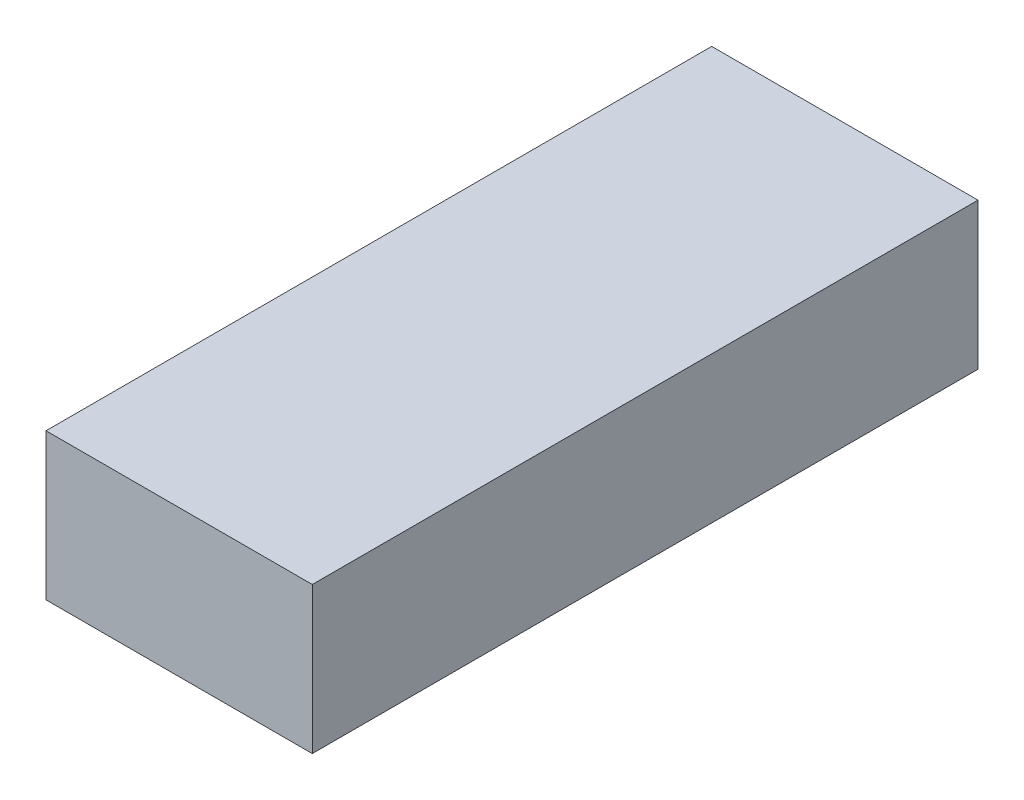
ISO-10303-21;
HEADER;
FILE_DESCRIPTION(('STEP AP214'),'2;1');
FILE_NAME('part.step','',(''),(''),'','','');
FILE_SCHEMA(('AUTOMOTIVE_DESIGN { 1 0 10303 214 1 1 1 1 }'));
ENDSEC;
DATA;
#1=APPLICATION_CONTEXT('core data for automotive mechanical design processes');
#2=APPLICATION_PROTOCOL_DEFINITION('international standard','automotive_design',2000,#1);
#3=PRODUCT_CONTEXT('',#1,'mechanical');
#4=PRODUCT('Part','Part','',(#3));
#5=PRODUCT_RELATED_PRODUCT_CATEGORY('part','',(#4));
#6=PRODUCT_DEFINITION_FORMATION('','',#4);
#7=PRODUCT_DEFINITION_CONTEXT('part definition',#1,'design');
#8=PRODUCT_DEFINITION('design','',#6,#7);
#9=PRODUCT_DEFINITION_SHAPE('','',#8);
#10=(LENGTH_UNIT() NAMED_UNIT(*) SI_UNIT(.MILLI.,.METRE.));
#11=(NAMED_UNIT(*) PLANE_ANGLE_UNIT() SI_UNIT($,.RADIAN.));
#12=(NAMED_UNIT(*) SI_UNIT($,.STERADIAN.) SOLID_ANGLE_UNIT());
#13=UNCERTAINTY_MEASURE_WITH_UNIT(LENGTH_MEASURE(1.E-05),#10,'distance_accuracy_value','');
#14=(GEOMETRIC_REPRESENTATION_CONTEXT(3) GLOBAL_UNCERTAINTY_ASSIGNED_CONTEXT((#13)) GLOBAL_UNIT_ASSIGNED_CONTEXT((#10,
#11,#12)) REPRESENTATION_CONTEXT('',''));
#15=CARTESIAN_POINT('',(0.,0.,0.));
#16=DIRECTION('',(0.,0.,1.));
#17=DIRECTION('',(1.,0.,0.));
#18=AXIS2_PLACEMENT_3D('',#15,#16,#17);
#19=CARTESIAN_POINT('',(0.,0.,50.));
#20=DIRECTION('',(1.,0.,0.));
#21=DIRECTION('',(0.,0.,-1.));
#22=AXIS2_PLACEMENT_3D('',#19,#20,#21);
#23=PLANE('',#22);
#24=DIRECTION('',(0.,-1.,0.));
#25=VECTOR('',#24,1.);
#26=CARTESIAN_POINT('',(0.,0.,0.));
#27=LINE('',#26,#25);
#28=CARTESIAN_POINT('',(0.,11.,0.));
#29=VERTEX_POINT('',#28);
#30=CARTESIAN_POINT('',(0.,0.,0.));
#31=VERTEX_POINT('',#30);
#32=EDGE_CURVE('E113',#29,#31,#27,.T.);
#33=ORIENTED_EDGE('',*,*,#32,.T.);
#34=DIRECTION('',(0.,0.,-1.));
#35=VECTOR('',#34,1.);
#36=CARTESIAN_POINT('',(0.,0.,50.));
#37=LINE('',#36,#35);
#38=CARTESIAN_POINT('',(0.,0.,50.));
#39=VERTEX_POINT('',#38);
#40=EDGE_CURVE('E11',#39,#31,#37,.T.);
#41=ORIENTED_EDGE('',*,*,#40,.F.);
#42=DIRECTION('',(0.,-1.,0.));
#43=VECTOR('',#42,1.);
#44=CARTESIAN_POINT('',(0.,0.,50.));
#45=LINE('',#44,#43);
#46=CARTESIAN_POINT('',(0.,11.,50.));
#47=VERTEX_POINT('',#46);
#48=EDGE_CURVE('E97',#47,#39,#45,.T.);
#49=ORIENTED_EDGE('',*,*,#48,.F.);
#50=DIRECTION('',(0.,0.,-1.));
#51=VECTOR('',#50,1.);
#52=CARTESIAN_POINT('',(0.,11.,50.));
#53=LINE('',#52,#51);
#54=EDGE_CURVE('E109',#47,#29,#53,.T.);
#55=ORIENTED_EDGE('',*,*,#54,.T.);
#56=EDGE_LOOP('',(#33,#41,#49,#55));
#57=FACE_BOUND('',#56,.T.);
#58=ADVANCED_FACE('F45',(#57),#23,.F.);
#59=CARTESIAN_POINT('',(0.,0.,50.));
#60=DIRECTION('',(0.,1.,0.));
#61=DIRECTION('',(0.,0.,1.));
#62=AXIS2_PLACEMENT_3D('',#59,#60,#61);
#63=PLANE('',#62);
#64=DIRECTION('',(1.,0.,0.));
#65=VECTOR('',#64,1.);
#66=CARTESIAN_POINT('',(0.,0.,0.));
#67=LINE('',#66,#65);
#68=CARTESIAN_POINT('',(20.,0.,0.));
#69=VERTEX_POINT('',#68);
#70=EDGE_CURVE('E102',#31,#69,#67,.T.);
#71=ORIENTED_EDGE('',*,*,#70,.T.);
#72=DIRECTION('',(0.,0.,-1.));
#73=VECTOR('',#72,1.);
#74=CARTESIAN_POINT('',(20.,0.,50.));
#75=LINE('',#74,#73);
#76=CARTESIAN_POINT('',(20.,0.,50.));
#77=VERTEX_POINT('',#76);
#78=EDGE_CURVE('E54',#77,#69,#75,.T.);
#79=ORIENTED_EDGE('',*,*,#78,.F.);
#80=DIRECTION('',(1.,0.,0.));
#81=VECTOR('',#80,1.);
#82=CARTESIAN_POINT('',(0.,0.,50.));
#83=LINE('',#82,#81);
#84=EDGE_CURVE('E92',#39,#77,#83,.T.);
#85=ORIENTED_EDGE('',*,*,#84,.F.);
#86=ORIENTED_EDGE('',*,*,#40,.T.);
#87=EDGE_LOOP('',(#71,#79,#85,#86));
#88=FACE_BOUND('',#87,.T.);
#89=ADVANCED_FACE('F101',(#88),#63,.F.);
#90=CARTESIAN_POINT('',(20.,0.,50.));
#91=DIRECTION('',(-1.,0.,0.));
#92=DIRECTION('',(0.,-1.,0.));
#93=AXIS2_PLACEMENT_3D('',#90,#91,#92);
#94=PLANE('',#93);
#95=DIRECTION('',(0.,1.,0.));
#96=VECTOR('',#95,1.);
#97=CARTESIAN_POINT('',(20.,0.,0.));
#98=LINE('',#97,#96);
#99=CARTESIAN_POINT('',(20.,11.,0.));
#100=VERTEX_POINT('',#99);
#101=EDGE_CURVE('E79',#69,#100,#98,.T.);
#102=ORIENTED_EDGE('',*,*,#101,.T.);
#103=DIRECTION('',(0.,0.,-1.));
#104=VECTOR('',#103,1.);
#105=CARTESIAN_POINT('',(20.,11.,50.));
#106=LINE('',#105,#104);
#107=CARTESIAN_POINT('',(20.,11.,50.));
#108=VERTEX_POINT('',#107);
#109=EDGE_CURVE('E104',#108,#100,#106,.T.);
#110=ORIENTED_EDGE('',*,*,#109,.F.);
#111=DIRECTION('',(0.,1.,0.));
#112=VECTOR('',#111,1.);
#113=CARTESIAN_POINT('',(20.,0.,50.));
#114=LINE('',#113,#112);
#115=EDGE_CURVE('E95',#77,#108,#114,.T.);
#116=ORIENTED_EDGE('',*,*,#115,.F.);
#117=ORIENTED_EDGE('',*,*,#78,.T.);
#118=EDGE_LOOP('',(#102,#110,#116,#117));
#119=FACE_BOUND('',#118,.T.);
#120=ADVANCED_FACE('F105',(#119),#94,.F.);
#121=CARTESIAN_POINT('',(0.,11.,50.));
#122=DIRECTION('',(0.,-1.,0.));
#123=DIRECTION('',(0.,0.,-1.));
#124=AXIS2_PLACEMENT_3D('',#121,#122,#123);
#125=PLANE('',#124);
#126=DIRECTION('',(-1.,0.,0.));
#127=VECTOR('',#126,1.);
#128=CARTESIAN_POINT('',(0.,11.,0.));
#129=LINE('',#128,#127);
#130=EDGE_CURVE('E85',#100,#29,#129,.T.);
#131=ORIENTED_EDGE('',*,*,#130,.T.);
#132=ORIENTED_EDGE('',*,*,#54,.F.);
#133=DIRECTION('',(-1.,0.,0.));
#134=VECTOR('',#133,1.);
#135=CARTESIAN_POINT('',(0.,11.,50.));
#136=LINE('',#135,#134);
#137=EDGE_CURVE('E62',#108,#47,#136,.T.);
#138=ORIENTED_EDGE('',*,*,#137,.F.);
#139=ORIENTED_EDGE('',*,*,#109,.T.);
#140=EDGE_LOOP('',(#131,#132,#138,#139));
#141=FACE_BOUND('',#140,.T.);
#142=ADVANCED_FACE('F126',(#141),#125,.F.);
#143=CARTESIAN_POINT('',(0.,0.,50.));
#144=DIRECTION('',(0.,0.,-1.));
#145=DIRECTION('',(-1.,0.,0.));
#146=AXIS2_PLACEMENT_3D('',#143,#144,#145);
#147=PLANE('',#146);
#148=ORIENTED_EDGE('',*,*,#48,.T.);
#149=ORIENTED_EDGE('',*,*,#84,.T.);
#150=ORIENTED_EDGE('',*,*,#115,.T.);
#151=ORIENTED_EDGE('',*,*,#137,.T.);
#152=EDGE_LOOP('',(#148,#149,#150,#151));
#153=FACE_BOUND('',#152,.T.);
#154=ADVANCED_FACE('F93',(#153),#147,.F.);
#155=CARTESIAN_POINT('',(0.,0.,0.));
#156=DIRECTION('',(0.,0.,-1.));
#157=DIRECTION('',(-1.,0.,0.));
#158=AXIS2_PLACEMENT_3D('',#155,#156,#157);
#159=PLANE('',#158);
#160=ORIENTED_EDGE('',*,*,#32,.F.);
#161=ORIENTED_EDGE('',*,*,#130,.F.);
#162=ORIENTED_EDGE('',*,*,#101,.F.);
#163=ORIENTED_EDGE('',*,*,#70,.F.);
#164=EDGE_LOOP('',(#160,#161,#162,#163));
#165=FACE_BOUND('',#164,.T.);
#166=ADVANCED_FACE('F129',(#165),#159,.T.);
#167=CLOSED_SHELL('',(#58,#89,#120,#142,#154,#166));
#168=MANIFOLD_SOLID_BREP('B2',#167);
#169=ADVANCED_BREP_SHAPE_REPRESENTATION('',(#18,#168),#14);
#170=SHAPE_DEFINITION_REPRESENTATION(#9,#169);
ENDSEC;
END-ISO-10303-21;
